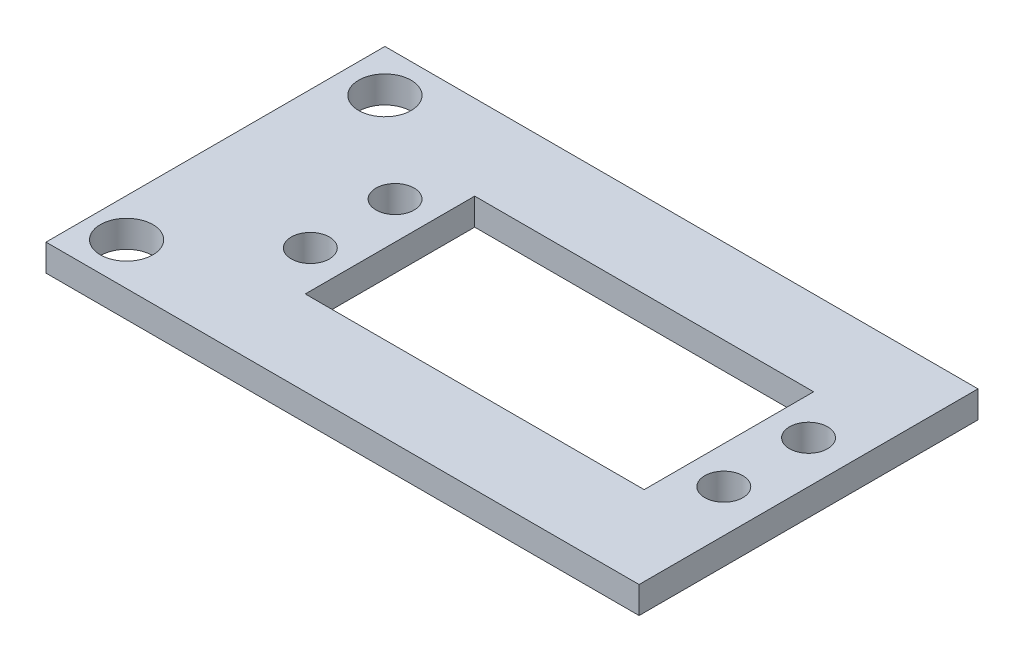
from build123d import *

# Parameters (mm, degrees)
SKETCH1_W           = 70
SKETCH1_H           = 40
SKETCH1_R           = 2.25
SKETCH1_R_2         = 3.1
SKETCH1_W_2         = 40
SKETCH1_H_2         = 20
BOSS_EXTRUDE1_DEPTH = 3.175


with BuildPart() as part:
    # Sketch1 → Boss-Extrude1 (new body)
    with BuildSketch(Plane(origin=(0, 0, 0), x_dir=(1, 0, 0), z_dir=(0, 1, 0))):
        Rectangle(SKETCH1_W, SKETCH1_H)
        with Locations(Location((30, 5, 0), (0, 0, 270))):
            Circle(SKETCH1_R, mode=Mode.SUBTRACT)
        with Locations(Location((-18.8, 5, 0), (0, 0, 270))):
            Circle(SKETCH1_R, mode=Mode.SUBTRACT)
        with Locations(Location((-18.8, -5, 0), (0, 0, 270))):
            Circle(SKETCH1_R, mode=Mode.SUBTRACT)
        with Locations(Location((30, -5, 0), (0, 0, 270))):
            Circle(SKETCH1_R, mode=Mode.SUBTRACT)
        with Locations(Location((-30, 15, 0), (0, 0, 270))):
            Circle(SKETCH1_R_2, mode=Mode.SUBTRACT)
        with Locations(Location((-30.486667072, -15, 0), (0, 0, 270))):
            Circle(SKETCH1_R_2, mode=Mode.SUBTRACT)
        with Locations((5.6, 0)):
            Rectangle(SKETCH1_W_2, SKETCH1_H_2, mode=Mode.SUBTRACT)
    extrude(amount=BOSS_EXTRUDE1_DEPTH)


solid = part.part
